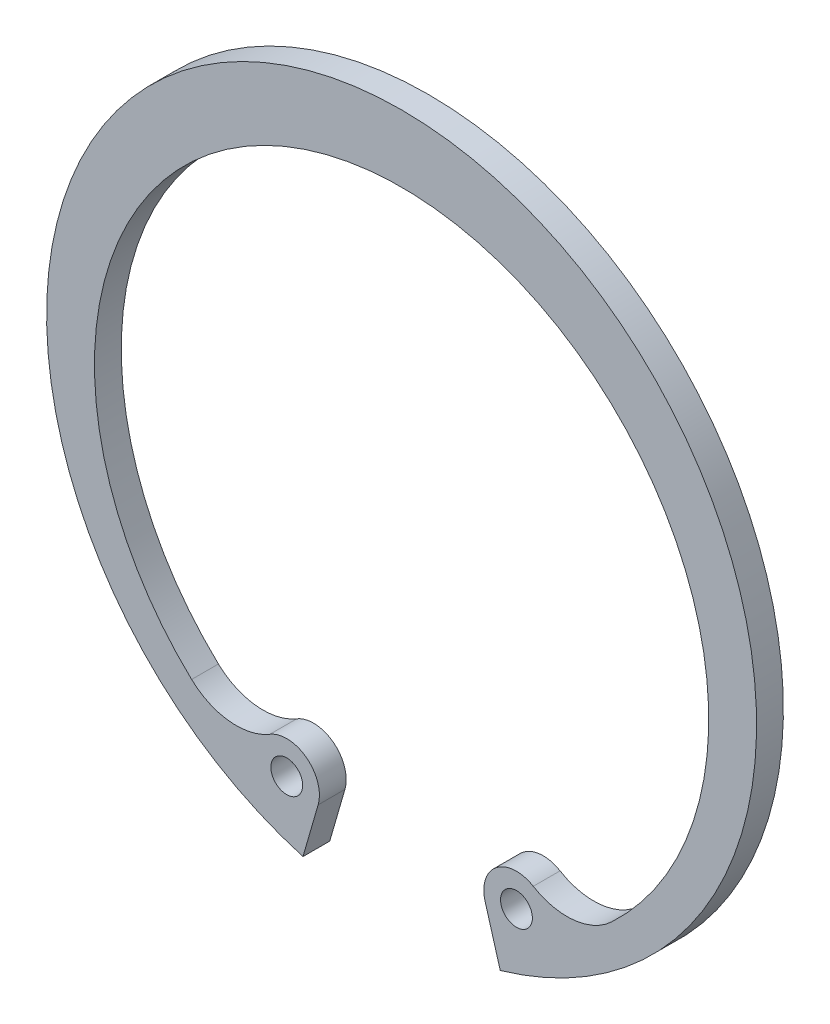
from build123d import *

# Parameters (mm, degrees)
BODYSKE_R  = 0.95
BODY_DEPTH = 1.6


with BuildPart() as part:
    # BodySke → Body (new body)
    with BuildSketch(Plane.XY):
        with BuildLine():
            Line((5.890472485, -20.36522364), (4.985884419, -17.237777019))
            ThreePointArc((4.985884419, -17.237777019), (5.670467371, -15.150115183), (7.863930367, -15.02479222))
            ThreePointArc((7.863930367, -15.02479222), (10.285062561, -15.560680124), (12.539845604, -14.528686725))
            ThreePointArc((12.539845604, -14.528686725), (0, 17.2), (-12.539845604, -14.528686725))
            ThreePointArc((-12.539845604, -14.528686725), (-10.285062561, -15.560680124), (-7.863930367, -15.02479222))
            ThreePointArc((-7.863930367, -15.02479222), (-5.670467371, -15.150115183), (-4.985884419, -17.237777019))
            Line((-4.985884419, -17.237777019), (-5.890472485, -20.36522364))
            ThreePointArc((-5.890472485, -20.36522364), (0, 21.2), (5.890472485, -20.36522364))
        make_face()
        with Locations((6.859100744, -16.695964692)):
            Circle(BODYSKE_R, mode=Mode.SUBTRACT)
        with Locations((-6.859100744, -16.695964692)):
            Circle(BODYSKE_R, mode=Mode.SUBTRACT)
    extrude(amount=-BODY_DEPTH)


solid = part.part
